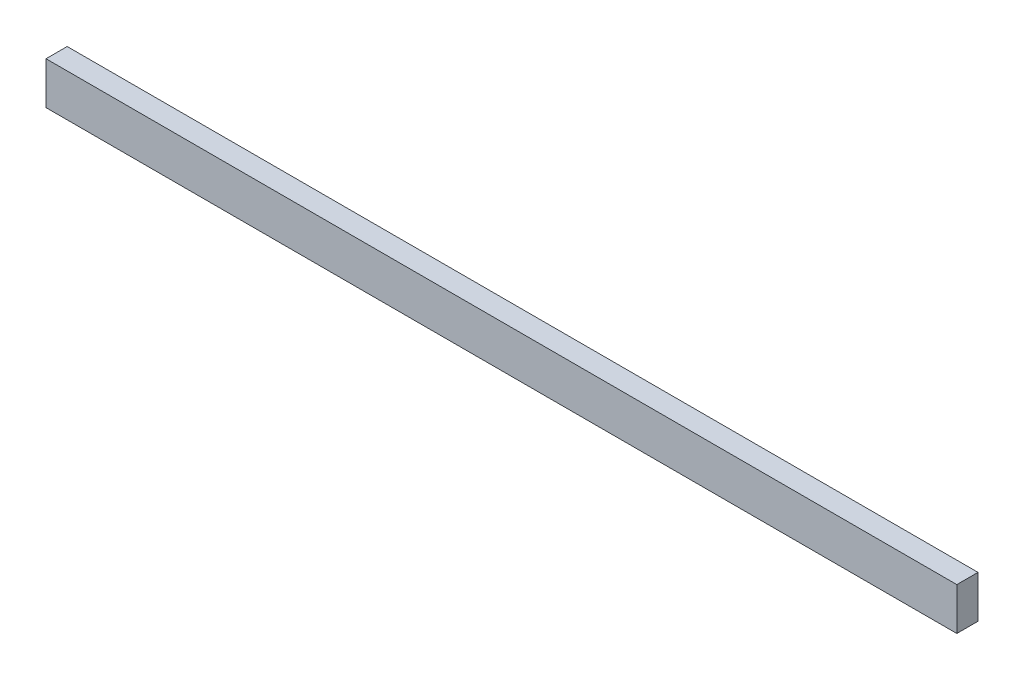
ISO-10303-21;
HEADER;
FILE_DESCRIPTION(('STEP AP214'),'2;1');
FILE_NAME('part.step','',(''),(''),'','','');
FILE_SCHEMA(('AUTOMOTIVE_DESIGN { 1 0 10303 214 1 1 1 1 }'));
ENDSEC;
DATA;
#1=APPLICATION_CONTEXT('core data for automotive mechanical design processes');
#2=APPLICATION_PROTOCOL_DEFINITION('international standard','automotive_design',2000,#1);
#3=PRODUCT_CONTEXT('',#1,'mechanical');
#4=PRODUCT('Part','Part','',(#3));
#5=PRODUCT_RELATED_PRODUCT_CATEGORY('part','',(#4));
#6=PRODUCT_DEFINITION_FORMATION('','',#4);
#7=PRODUCT_DEFINITION_CONTEXT('part definition',#1,'design');
#8=PRODUCT_DEFINITION('design','',#6,#7);
#9=PRODUCT_DEFINITION_SHAPE('','',#8);
#10=(LENGTH_UNIT() NAMED_UNIT(*) SI_UNIT(.MILLI.,.METRE.));
#11=(NAMED_UNIT(*) PLANE_ANGLE_UNIT() SI_UNIT($,.RADIAN.));
#12=(NAMED_UNIT(*) SI_UNIT($,.STERADIAN.) SOLID_ANGLE_UNIT());
#13=UNCERTAINTY_MEASURE_WITH_UNIT(LENGTH_MEASURE(1.E-05),#10,'distance_accuracy_value','');
#14=(GEOMETRIC_REPRESENTATION_CONTEXT(3) GLOBAL_UNCERTAINTY_ASSIGNED_CONTEXT((#13)) GLOBAL_UNIT_ASSIGNED_CONTEXT((#10,
#11,#12)) REPRESENTATION_CONTEXT('',''));
#15=CARTESIAN_POINT('',(0.,0.,0.));
#16=DIRECTION('',(0.,0.,1.));
#17=DIRECTION('',(1.,0.,0.));
#18=AXIS2_PLACEMENT_3D('',#15,#16,#17);
#19=CARTESIAN_POINT('',(0.,0.,9.525));
#20=DIRECTION('',(0.,1.,0.));
#21=DIRECTION('',(0.,0.,1.));
#22=AXIS2_PLACEMENT_3D('',#19,#20,#21);
#23=PLANE('',#22);
#24=DIRECTION('',(1.,0.,0.));
#25=VECTOR('',#24,1.);
#26=CARTESIAN_POINT('',(0.,0.,0.));
#27=LINE('',#26,#25);
#28=CARTESIAN_POINT('',(0.,0.,0.));
#29=VERTEX_POINT('',#28);
#30=CARTESIAN_POINT('',(409.575,0.,0.));
#31=VERTEX_POINT('',#30);
#32=EDGE_CURVE('E97',#29,#31,#27,.T.);
#33=ORIENTED_EDGE('',*,*,#32,.T.);
#34=DIRECTION('',(0.,0.,-1.));
#35=VECTOR('',#34,1.);
#36=CARTESIAN_POINT('',(409.575,0.,9.525));
#37=LINE('',#36,#35);
#38=CARTESIAN_POINT('',(409.575,0.,9.525));
#39=VERTEX_POINT('',#38);
#40=EDGE_CURVE('E11',#39,#31,#37,.T.);
#41=ORIENTED_EDGE('',*,*,#40,.F.);
#42=DIRECTION('',(1.,0.,0.));
#43=VECTOR('',#42,1.);
#44=CARTESIAN_POINT('',(0.,0.,9.525));
#45=LINE('',#44,#43);
#46=CARTESIAN_POINT('',(0.,0.,9.525));
#47=VERTEX_POINT('',#46);
#48=EDGE_CURVE('E83',#47,#39,#45,.T.);
#49=ORIENTED_EDGE('',*,*,#48,.F.);
#50=DIRECTION('',(0.,0.,-1.));
#51=VECTOR('',#50,1.);
#52=CARTESIAN_POINT('',(0.,0.,9.525));
#53=LINE('',#52,#51);
#54=EDGE_CURVE('E50',#47,#29,#53,.T.);
#55=ORIENTED_EDGE('',*,*,#54,.T.);
#56=EDGE_LOOP('',(#33,#41,#49,#55));
#57=FACE_BOUND('',#56,.T.);
#58=ADVANCED_FACE('F34',(#57),#23,.F.);
#59=CARTESIAN_POINT('',(409.575,0.,9.525));
#60=DIRECTION('',(-1.,0.,0.));
#61=DIRECTION('',(0.,0.,1.));
#62=AXIS2_PLACEMENT_3D('',#59,#60,#61);
#63=PLANE('',#62);
#64=DIRECTION('',(0.,1.,0.));
#65=VECTOR('',#64,1.);
#66=CARTESIAN_POINT('',(409.575,0.,0.));
#67=LINE('',#66,#65);
#68=CARTESIAN_POINT('',(409.575,19.05,0.));
#69=VERTEX_POINT('',#68);
#70=EDGE_CURVE('E88',#31,#69,#67,.T.);
#71=ORIENTED_EDGE('',*,*,#70,.T.);
#72=DIRECTION('',(0.,0.,-1.));
#73=VECTOR('',#72,1.);
#74=CARTESIAN_POINT('',(409.575,19.05,9.525));
#75=LINE('',#74,#73);
#76=CARTESIAN_POINT('',(409.575,19.05,9.525));
#77=VERTEX_POINT('',#76);
#78=EDGE_CURVE('E42',#77,#69,#75,.T.);
#79=ORIENTED_EDGE('',*,*,#78,.F.);
#80=DIRECTION('',(0.,1.,0.));
#81=VECTOR('',#80,1.);
#82=CARTESIAN_POINT('',(409.575,0.,9.525));
#83=LINE('',#82,#81);
#84=EDGE_CURVE('E75',#39,#77,#83,.T.);
#85=ORIENTED_EDGE('',*,*,#84,.F.);
#86=ORIENTED_EDGE('',*,*,#40,.T.);
#87=EDGE_LOOP('',(#71,#79,#85,#86));
#88=FACE_BOUND('',#87,.T.);
#89=ADVANCED_FACE('F87',(#88),#63,.F.);
#90=CARTESIAN_POINT('',(0.,19.05,9.525));
#91=DIRECTION('',(0.,1.,0.));
#92=DIRECTION('',(0.,0.,1.));
#93=AXIS2_PLACEMENT_3D('',#90,#91,#92);
#94=PLANE('',#93);
#95=DIRECTION('',(1.,0.,0.));
#96=VECTOR('',#95,1.);
#97=CARTESIAN_POINT('',(0.,19.05,0.));
#98=LINE('',#97,#96);
#99=CARTESIAN_POINT('',(0.,19.05,0.));
#100=VERTEX_POINT('',#99);
#101=EDGE_CURVE('E100',#100,#69,#98,.T.);
#102=ORIENTED_EDGE('',*,*,#101,.F.);
#103=DIRECTION('',(0.,0.,-1.));
#104=VECTOR('',#103,1.);
#105=CARTESIAN_POINT('',(0.,19.05,9.525));
#106=LINE('',#105,#104);
#107=CARTESIAN_POINT('',(0.,19.05,9.525));
#108=VERTEX_POINT('',#107);
#109=EDGE_CURVE('E64',#108,#100,#106,.T.);
#110=ORIENTED_EDGE('',*,*,#109,.F.);
#111=DIRECTION('',(1.,0.,0.));
#112=VECTOR('',#111,1.);
#113=CARTESIAN_POINT('',(0.,19.05,9.525));
#114=LINE('',#113,#112);
#115=EDGE_CURVE('E82',#108,#77,#114,.T.);
#116=ORIENTED_EDGE('',*,*,#115,.T.);
#117=ORIENTED_EDGE('',*,*,#78,.T.);
#118=EDGE_LOOP('',(#102,#110,#116,#117));
#119=FACE_BOUND('',#118,.T.);
#120=ADVANCED_FACE('F91',(#119),#94,.T.);
#121=CARTESIAN_POINT('',(0.,0.,9.525));
#122=DIRECTION('',(-1.,0.,0.));
#123=DIRECTION('',(0.,0.,1.));
#124=AXIS2_PLACEMENT_3D('',#121,#122,#123);
#125=PLANE('',#124);
#126=DIRECTION('',(0.,1.,0.));
#127=VECTOR('',#126,1.);
#128=CARTESIAN_POINT('',(0.,0.,0.));
#129=LINE('',#128,#127);
#130=EDGE_CURVE('E102',#29,#100,#129,.T.);
#131=ORIENTED_EDGE('',*,*,#130,.F.);
#132=ORIENTED_EDGE('',*,*,#54,.F.);
#133=DIRECTION('',(0.,1.,0.));
#134=VECTOR('',#133,1.);
#135=CARTESIAN_POINT('',(0.,0.,9.525));
#136=LINE('',#135,#134);
#137=EDGE_CURVE('E92',#47,#108,#136,.T.);
#138=ORIENTED_EDGE('',*,*,#137,.T.);
#139=ORIENTED_EDGE('',*,*,#109,.T.);
#140=EDGE_LOOP('',(#131,#132,#138,#139));
#141=FACE_BOUND('',#140,.T.);
#142=ADVANCED_FACE('F108',(#141),#125,.T.);
#143=CARTESIAN_POINT('',(0.,0.,9.525));
#144=DIRECTION('',(0.,0.,1.));
#145=DIRECTION('',(1.,0.,0.));
#146=AXIS2_PLACEMENT_3D('',#143,#144,#145);
#147=PLANE('',#146);
#148=ORIENTED_EDGE('',*,*,#48,.T.);
#149=ORIENTED_EDGE('',*,*,#84,.T.);
#150=ORIENTED_EDGE('',*,*,#115,.F.);
#151=ORIENTED_EDGE('',*,*,#137,.F.);
#152=EDGE_LOOP('',(#148,#149,#150,#151));
#153=FACE_BOUND('',#152,.T.);
#154=ADVANCED_FACE('F79',(#153),#147,.T.);
#155=CARTESIAN_POINT('',(0.,0.,0.));
#156=DIRECTION('',(0.,0.,1.));
#157=DIRECTION('',(1.,0.,0.));
#158=AXIS2_PLACEMENT_3D('',#155,#156,#157);
#159=PLANE('',#158);
#160=ORIENTED_EDGE('',*,*,#32,.F.);
#161=ORIENTED_EDGE('',*,*,#130,.T.);
#162=ORIENTED_EDGE('',*,*,#101,.T.);
#163=ORIENTED_EDGE('',*,*,#70,.F.);
#164=EDGE_LOOP('',(#160,#161,#162,#163));
#165=FACE_BOUND('',#164,.T.);
#166=ADVANCED_FACE('F107',(#165),#159,.F.);
#167=CLOSED_SHELL('',(#58,#89,#120,#142,#154,#166));
#168=MANIFOLD_SOLID_BREP('B2',#167);
#169=ADVANCED_BREP_SHAPE_REPRESENTATION('',(#18,#168),#14);
#170=SHAPE_DEFINITION_REPRESENTATION(#9,#169);
ENDSEC;
END-ISO-10303-21;
